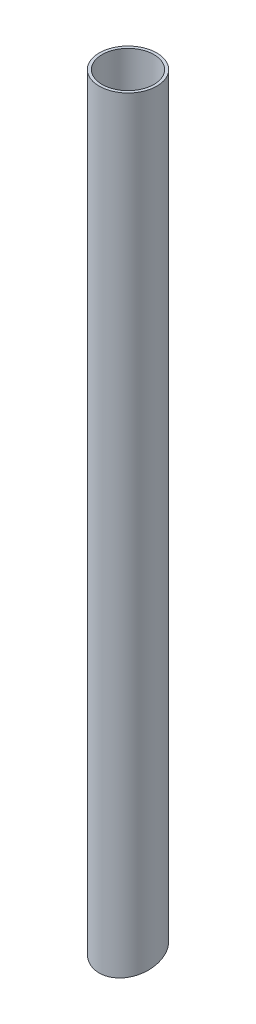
from build123d import *

# Parameters (mm, degrees)
SKIZZE1_R                            = 15
SKIZZE1_R_2                          = 13.5
LINEAR_AUSTRAGEN_D_NN1_DEPTH         = 400
SCHNITT_LINEAR_AUSTRAGEN1_DEPTH      = 401.562105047
SCHNITT_LINEAR_AUSTRAGEN1_DEPTH_BACK = 401.562105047


with BuildPart() as part:
    # Skizze1 → Linear-Austragen-D_nn1 (new body)
    with BuildSketch(Plane(origin=(0, 0, 0), x_dir=(1, 0, 0), z_dir=(0, 1, 0))):
        Circle(SKIZZE1_R)
        Circle(SKIZZE1_R_2, mode=Mode.SUBTRACT)
    extrude(amount=LINEAR_AUSTRAGEN_D_NN1_DEPTH)

    # Skizze2 → Schnitt-Linear austragen1 (cut, two sides: drawn at the far end of the back side and taken through both)
    with BuildSketch(Plane(origin=(0, 0, 0), x_dir=(0, 0, -1), z_dir=(1, 0, 0)).offset(-SCHNITT_LINEAR_AUSTRAGEN1_DEPTH_BACK)):
        Polygon((-799.570204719, -210.22495276), (-15, 0), (15, 8.038475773), (799.570204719, 218.263428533), (1220.020110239, -1350.876980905), (-379.120299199, -1779.365362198), align=None)
    extrude(amount=SCHNITT_LINEAR_AUSTRAGEN1_DEPTH + SCHNITT_LINEAR_AUSTRAGEN1_DEPTH_BACK, mode=Mode.SUBTRACT)


solid = part.part
